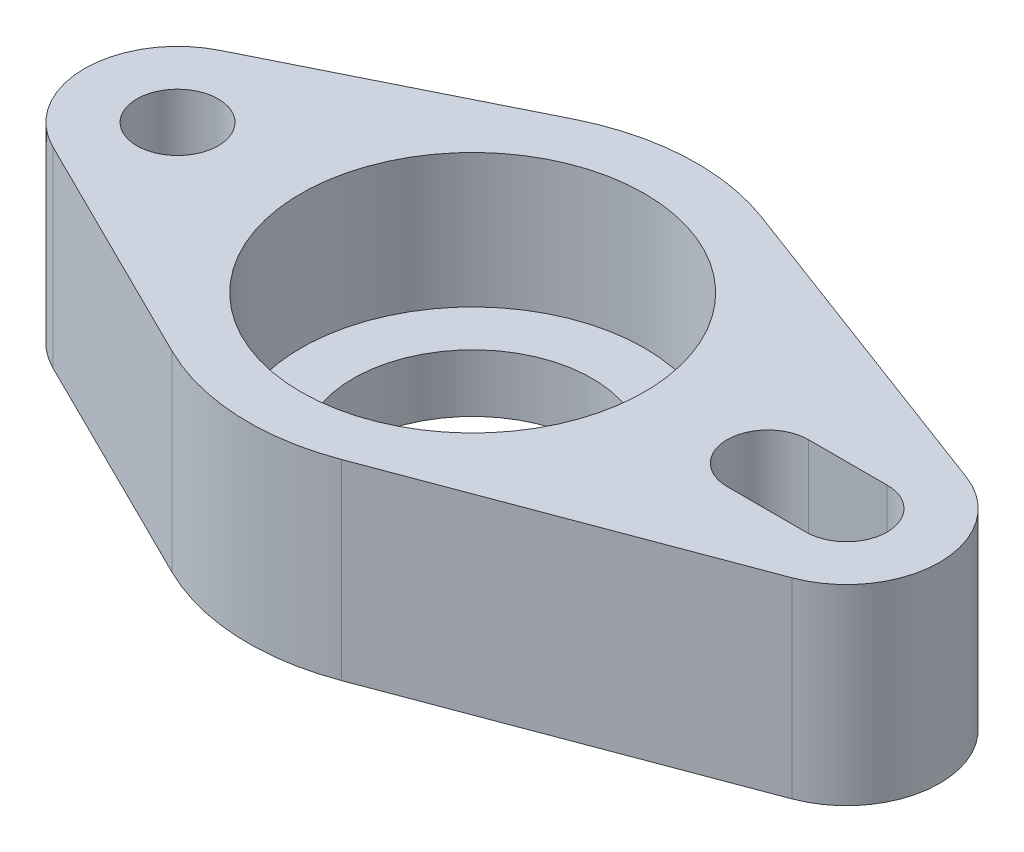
ISO-10303-21;
HEADER;
FILE_DESCRIPTION(('STEP AP214'),'2;1');
FILE_NAME('part.step','',(''),(''),'','','');
FILE_SCHEMA(('AUTOMOTIVE_DESIGN { 1 0 10303 214 1 1 1 1 }'));
ENDSEC;
DATA;
#1=APPLICATION_CONTEXT('core data for automotive mechanical design processes');
#2=APPLICATION_PROTOCOL_DEFINITION('international standard','automotive_design',2000,#1);
#3=PRODUCT_CONTEXT('',#1,'mechanical');
#4=PRODUCT('Part','Part','',(#3));
#5=PRODUCT_RELATED_PRODUCT_CATEGORY('part','',(#4));
#6=PRODUCT_DEFINITION_FORMATION('','',#4);
#7=PRODUCT_DEFINITION_CONTEXT('part definition',#1,'design');
#8=PRODUCT_DEFINITION('design','',#6,#7);
#9=PRODUCT_DEFINITION_SHAPE('','',#8);
#10=(LENGTH_UNIT() NAMED_UNIT(*) SI_UNIT(.MILLI.,.METRE.));
#11=(NAMED_UNIT(*) PLANE_ANGLE_UNIT() SI_UNIT($,.RADIAN.));
#12=(NAMED_UNIT(*) SI_UNIT($,.STERADIAN.) SOLID_ANGLE_UNIT());
#13=UNCERTAINTY_MEASURE_WITH_UNIT(LENGTH_MEASURE(1.E-05),#10,'distance_accuracy_value','');
#14=(GEOMETRIC_REPRESENTATION_CONTEXT(3) GLOBAL_UNCERTAINTY_ASSIGNED_CONTEXT((#13)) GLOBAL_UNIT_ASSIGNED_CONTEXT((#10,
#11,#12)) REPRESENTATION_CONTEXT('',''));
#15=CARTESIAN_POINT('',(0.,0.,0.));
#16=DIRECTION('',(0.,0.,1.));
#17=DIRECTION('',(1.,0.,0.));
#18=AXIS2_PLACEMENT_3D('',#15,#16,#17);
#19=CARTESIAN_POINT('',(3.,7.3,8.00640368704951));
#20=DIRECTION('',(0.350877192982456,0.,0.93642148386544));
#21=DIRECTION('',(0.93642148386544,0.,-0.350877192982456));
#22=AXIS2_PLACEMENT_3D('',#19,#20,#21);
#23=PLANE('',#22);
#24=DIRECTION('',(-0.93642148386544,0.,0.350877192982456));
#25=VECTOR('',#24,1.);
#26=CARTESIAN_POINT('',(3.,0.,8.00640368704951));
#27=LINE('',#26,#25);
#28=CARTESIAN_POINT('',(15.4956140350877,0.,3.32429626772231));
#29=VERTEX_POINT('',#28);
#30=CARTESIAN_POINT('',(3.,0.,8.00640368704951));
#31=VERTEX_POINT('',#30);
#32=EDGE_CURVE('E207',#29,#31,#27,.T.);
#33=ORIENTED_EDGE('',*,*,#32,.F.);
#34=DIRECTION('',(0.,-1.,0.));
#35=VECTOR('',#34,1.);
#36=CARTESIAN_POINT('',(15.4956140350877,7.3,3.32429626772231));
#37=LINE('',#36,#35);
#38=CARTESIAN_POINT('',(15.4956140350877,7.3,3.32429626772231));
#39=VERTEX_POINT('',#38);
#40=EDGE_CURVE('E50',#39,#29,#37,.T.);
#41=ORIENTED_EDGE('',*,*,#40,.F.);
#42=DIRECTION('',(-0.93642148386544,0.,0.350877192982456));
#43=VECTOR('',#42,1.);
#44=CARTESIAN_POINT('',(3.,7.3,8.00640368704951));
#45=LINE('',#44,#43);
#46=CARTESIAN_POINT('',(3.,7.3,8.00640368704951));
#47=VERTEX_POINT('',#46);
#48=EDGE_CURVE('E236',#39,#47,#45,.T.);
#49=ORIENTED_EDGE('',*,*,#48,.T.);
#50=DIRECTION('',(0.,-1.,0.));
#51=VECTOR('',#50,1.);
#52=CARTESIAN_POINT('',(3.,7.3,8.00640368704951));
#53=LINE('',#52,#51);
#54=EDGE_CURVE('E105',#47,#31,#53,.T.);
#55=ORIENTED_EDGE('',*,*,#54,.T.);
#56=EDGE_LOOP('',(#33,#41,#49,#55));
#57=FACE_BOUND('',#56,.T.);
#58=ADVANCED_FACE('F41',(#57),#23,.T.);
#59=CARTESIAN_POINT('',(14.25,7.3,0.));
#60=DIRECTION('',(0.,-1.,0.));
#61=DIRECTION('',(0.,0.,-1.));
#62=AXIS2_PLACEMENT_3D('',#59,#60,#61);
#63=CYLINDRICAL_SURFACE('',#62,3.55);
#64=CARTESIAN_POINT('',(14.25,0.,0.));
#65=DIRECTION('',(0.,1.,0.));
#66=DIRECTION('',(0.,0.,1.));
#67=AXIS2_PLACEMENT_3D('',#64,#65,#66);
#68=CIRCLE('',#67,3.55);
#69=CARTESIAN_POINT('',(15.4956140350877,0.,-3.32429626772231));
#70=VERTEX_POINT('',#69);
#71=EDGE_CURVE('E204',#29,#70,#68,.T.);
#72=ORIENTED_EDGE('',*,*,#71,.T.);
#73=DIRECTION('',(0.,-1.,0.));
#74=VECTOR('',#73,1.);
#75=CARTESIAN_POINT('',(15.4956140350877,7.3,-3.32429626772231));
#76=LINE('',#75,#74);
#77=CARTESIAN_POINT('',(15.4956140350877,7.3,-3.32429626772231));
#78=VERTEX_POINT('',#77);
#79=EDGE_CURVE('E173',#78,#70,#76,.T.);
#80=ORIENTED_EDGE('',*,*,#79,.F.);
#81=CARTESIAN_POINT('',(14.25,7.3,0.));
#82=DIRECTION('',(0.,1.,0.));
#83=DIRECTION('',(0.,0.,1.));
#84=AXIS2_PLACEMENT_3D('',#81,#82,#83);
#85=CIRCLE('',#84,3.55);
#86=EDGE_CURVE('E233',#39,#78,#85,.T.);
#87=ORIENTED_EDGE('',*,*,#86,.F.);
#88=ORIENTED_EDGE('',*,*,#40,.T.);
#89=EDGE_LOOP('',(#72,#80,#87,#88));
#90=FACE_BOUND('',#89,.T.);
#91=ADVANCED_FACE('F293',(#90),#63,.T.);
#92=CARTESIAN_POINT('',(3.,7.3,-8.00640368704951));
#93=DIRECTION('',(-0.350877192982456,0.,0.93642148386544));
#94=DIRECTION('',(0.93642148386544,0.,0.350877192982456));
#95=AXIS2_PLACEMENT_3D('',#92,#93,#94);
#96=PLANE('',#95);
#97=DIRECTION('',(-0.93642148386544,0.,-0.350877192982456));
#98=VECTOR('',#97,1.);
#99=CARTESIAN_POINT('',(3.,0.,-8.00640368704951));
#100=LINE('',#99,#98);
#101=CARTESIAN_POINT('',(3.,0.,-8.00640368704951));
#102=VERTEX_POINT('',#101);
#103=EDGE_CURVE('E201',#70,#102,#100,.T.);
#104=ORIENTED_EDGE('',*,*,#103,.T.);
#105=DIRECTION('',(0.,-1.,0.));
#106=VECTOR('',#105,1.);
#107=CARTESIAN_POINT('',(3.,7.3,-8.00640368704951));
#108=LINE('',#107,#106);
#109=CARTESIAN_POINT('',(3.,7.3,-8.00640368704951));
#110=VERTEX_POINT('',#109);
#111=EDGE_CURVE('E170',#110,#102,#108,.T.);
#112=ORIENTED_EDGE('',*,*,#111,.F.);
#113=DIRECTION('',(-0.93642148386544,0.,-0.350877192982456));
#114=VECTOR('',#113,1.);
#115=CARTESIAN_POINT('',(3.,7.3,-8.00640368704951));
#116=LINE('',#115,#114);
#117=EDGE_CURVE('E230',#78,#110,#116,.T.);
#118=ORIENTED_EDGE('',*,*,#117,.F.);
#119=ORIENTED_EDGE('',*,*,#79,.T.);
#120=EDGE_LOOP('',(#104,#112,#118,#119));
#121=FACE_BOUND('',#120,.T.);
#122=ADVANCED_FACE('F298',(#121),#96,.F.);
#123=CARTESIAN_POINT('',(0.,7.3,0.));
#124=DIRECTION('',(0.,-1.,0.));
#125=DIRECTION('',(0.,0.,-1.));
#126=AXIS2_PLACEMENT_3D('',#123,#124,#125);
#127=CYLINDRICAL_SURFACE('',#126,8.55);
#128=CARTESIAN_POINT('',(0.,0.,0.));
#129=DIRECTION('',(0.,1.,0.));
#130=DIRECTION('',(0.,0.,1.));
#131=AXIS2_PLACEMENT_3D('',#128,#129,#130);
#132=CIRCLE('',#131,8.55);
#133=CARTESIAN_POINT('',(-3.8,0.,-7.65914486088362));
#134=VERTEX_POINT('',#133);
#135=EDGE_CURVE('E198',#102,#134,#132,.T.);
#136=ORIENTED_EDGE('',*,*,#135,.T.);
#137=DIRECTION('',(0.,-1.,0.));
#138=VECTOR('',#137,1.);
#139=CARTESIAN_POINT('',(-3.8,7.3,-7.65914486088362));
#140=LINE('',#139,#138);
#141=CARTESIAN_POINT('',(-3.8,7.3,-7.65914486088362));
#142=VERTEX_POINT('',#141);
#143=EDGE_CURVE('E164',#142,#134,#140,.T.);
#144=ORIENTED_EDGE('',*,*,#143,.F.);
#145=CARTESIAN_POINT('',(0.,7.3,0.));
#146=DIRECTION('',(0.,1.,0.));
#147=DIRECTION('',(0.,0.,1.));
#148=AXIS2_PLACEMENT_3D('',#145,#146,#147);
#149=CIRCLE('',#148,8.55);
#150=EDGE_CURVE('E228',#110,#142,#149,.T.);
#151=ORIENTED_EDGE('',*,*,#150,.F.);
#152=ORIENTED_EDGE('',*,*,#111,.T.);
#153=EDGE_LOOP('',(#136,#144,#151,#152));
#154=FACE_BOUND('',#153,.T.);
#155=ADVANCED_FACE('F326',(#154),#127,.T.);
#156=CARTESIAN_POINT('',(-3.8,7.3,-7.65914486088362));
#157=DIRECTION('',(-0.444444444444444,0.,-0.895806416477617));
#158=DIRECTION('',(-0.895806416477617,0.,0.444444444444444));
#159=AXIS2_PLACEMENT_3D('',#156,#157,#158);
#160=PLANE('',#159);
#161=DIRECTION('',(0.895806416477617,0.,-0.444444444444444));
#162=VECTOR('',#161,1.);
#163=CARTESIAN_POINT('',(-3.8,0.,-7.65914486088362));
#164=LINE('',#163,#162);
#165=CARTESIAN_POINT('',(-12.8277777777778,0.,-3.18011277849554));
#166=VERTEX_POINT('',#165);
#167=EDGE_CURVE('E195',#166,#134,#164,.T.);
#168=ORIENTED_EDGE('',*,*,#167,.F.);
#169=DIRECTION('',(0.,-1.,0.));
#170=VECTOR('',#169,1.);
#171=CARTESIAN_POINT('',(-12.8277777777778,7.3,-3.18011277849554));
#172=LINE('',#171,#170);
#173=CARTESIAN_POINT('',(-12.8277777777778,7.3,-3.18011277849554));
#174=VERTEX_POINT('',#173);
#175=EDGE_CURVE('E162',#174,#166,#172,.T.);
#176=ORIENTED_EDGE('',*,*,#175,.F.);
#177=DIRECTION('',(0.895806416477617,0.,-0.444444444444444));
#178=VECTOR('',#177,1.);
#179=CARTESIAN_POINT('',(-3.8,7.3,-7.65914486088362));
#180=LINE('',#179,#178);
#181=EDGE_CURVE('E156',#174,#142,#180,.T.);
#182=ORIENTED_EDGE('',*,*,#181,.T.);
#183=ORIENTED_EDGE('',*,*,#143,.T.);
#184=EDGE_LOOP('',(#168,#176,#182,#183));
#185=FACE_BOUND('',#184,.T.);
#186=ADVANCED_FACE('F329',(#185),#160,.T.);
#187=CARTESIAN_POINT('',(-11.25,7.3,0.));
#188=DIRECTION('',(0.,-1.,0.));
#189=DIRECTION('',(0.,0.,-1.));
#190=AXIS2_PLACEMENT_3D('',#187,#188,#189);
#191=CYLINDRICAL_SURFACE('',#190,3.55);
#192=CARTESIAN_POINT('',(-11.25,0.,0.));
#193=DIRECTION('',(0.,1.,0.));
#194=DIRECTION('',(0.,0.,1.));
#195=AXIS2_PLACEMENT_3D('',#192,#193,#194);
#196=CIRCLE('',#195,3.55);
#197=CARTESIAN_POINT('',(-12.8277777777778,0.,3.18011277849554));
#198=VERTEX_POINT('',#197);
#199=EDGE_CURVE('E161',#166,#198,#196,.T.);
#200=ORIENTED_EDGE('',*,*,#199,.T.);
#201=DIRECTION('',(0.,-1.,0.));
#202=VECTOR('',#201,1.);
#203=CARTESIAN_POINT('',(-12.8277777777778,7.3,3.18011277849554));
#204=LINE('',#203,#202);
#205=CARTESIAN_POINT('',(-12.8277777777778,7.3,3.18011277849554));
#206=VERTEX_POINT('',#205);
#207=EDGE_CURVE('E146',#206,#198,#204,.T.);
#208=ORIENTED_EDGE('',*,*,#207,.F.);
#209=CARTESIAN_POINT('',(-11.25,7.3,0.));
#210=DIRECTION('',(0.,1.,0.));
#211=DIRECTION('',(0.,0.,1.));
#212=AXIS2_PLACEMENT_3D('',#209,#210,#211);
#213=CIRCLE('',#212,3.55);
#214=EDGE_CURVE('E149',#174,#206,#213,.T.);
#215=ORIENTED_EDGE('',*,*,#214,.F.);
#216=ORIENTED_EDGE('',*,*,#175,.T.);
#217=EDGE_LOOP('',(#200,#208,#215,#216));
#218=FACE_BOUND('',#217,.T.);
#219=ADVANCED_FACE('F159',(#218),#191,.T.);
#220=CARTESIAN_POINT('',(-3.8,7.3,7.65914486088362));
#221=DIRECTION('',(0.444444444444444,0.,-0.895806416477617));
#222=DIRECTION('',(-0.895806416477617,0.,-0.444444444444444));
#223=AXIS2_PLACEMENT_3D('',#220,#221,#222);
#224=PLANE('',#223);
#225=DIRECTION('',(0.895806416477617,0.,0.444444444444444));
#226=VECTOR('',#225,1.);
#227=CARTESIAN_POINT('',(-3.8,0.,7.65914486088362));
#228=LINE('',#227,#226);
#229=CARTESIAN_POINT('',(-3.8,0.,7.65914486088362));
#230=VERTEX_POINT('',#229);
#231=EDGE_CURVE('E192',#198,#230,#228,.T.);
#232=ORIENTED_EDGE('',*,*,#231,.T.);
#233=DIRECTION('',(0.,-1.,0.));
#234=VECTOR('',#233,1.);
#235=CARTESIAN_POINT('',(-3.8,7.3,7.65914486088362));
#236=LINE('',#235,#234);
#237=CARTESIAN_POINT('',(-3.8,7.3,7.65914486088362));
#238=VERTEX_POINT('',#237);
#239=EDGE_CURVE('E148',#238,#230,#236,.T.);
#240=ORIENTED_EDGE('',*,*,#239,.F.);
#241=DIRECTION('',(0.895806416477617,0.,0.444444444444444));
#242=VECTOR('',#241,1.);
#243=CARTESIAN_POINT('',(-3.8,7.3,7.65914486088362));
#244=LINE('',#243,#242);
#245=EDGE_CURVE('E141',#206,#238,#244,.T.);
#246=ORIENTED_EDGE('',*,*,#245,.F.);
#247=ORIENTED_EDGE('',*,*,#207,.T.);
#248=EDGE_LOOP('',(#232,#240,#246,#247));
#249=FACE_BOUND('',#248,.T.);
#250=ADVANCED_FACE('F144',(#249),#224,.F.);
#251=CARTESIAN_POINT('',(11.25,7.3,0.));
#252=DIRECTION('',(0.,-1.,0.));
#253=DIRECTION('',(0.,0.,-1.));
#254=AXIS2_PLACEMENT_3D('',#251,#252,#253);
#255=CYLINDRICAL_SURFACE('',#254,1.55);
#256=CARTESIAN_POINT('',(11.25,0.,0.));
#257=DIRECTION('',(0.,1.,0.));
#258=DIRECTION('',(0.,0.,1.));
#259=AXIS2_PLACEMENT_3D('',#256,#257,#258);
#260=CIRCLE('',#259,1.55);
#261=CARTESIAN_POINT('',(11.25,0.,-1.55));
#262=VERTEX_POINT('',#261);
#263=CARTESIAN_POINT('',(11.25,0.,1.55));
#264=VERTEX_POINT('',#263);
#265=EDGE_CURVE('E217',#262,#264,#260,.T.);
#266=ORIENTED_EDGE('',*,*,#265,.F.);
#267=DIRECTION('',(0.,-1.,0.));
#268=VECTOR('',#267,1.);
#269=CARTESIAN_POINT('',(11.25,7.3,-1.55));
#270=LINE('',#269,#268);
#271=CARTESIAN_POINT('',(11.25,7.3,-1.55));
#272=VERTEX_POINT('',#271);
#273=EDGE_CURVE('E112',#272,#262,#270,.T.);
#274=ORIENTED_EDGE('',*,*,#273,.F.);
#275=CARTESIAN_POINT('',(11.25,7.3,0.));
#276=DIRECTION('',(0.,1.,0.));
#277=DIRECTION('',(0.,0.,1.));
#278=AXIS2_PLACEMENT_3D('',#275,#276,#277);
#279=CIRCLE('',#278,1.55);
#280=CARTESIAN_POINT('',(11.25,7.3,1.55));
#281=VERTEX_POINT('',#280);
#282=EDGE_CURVE('E190',#272,#281,#279,.T.);
#283=ORIENTED_EDGE('',*,*,#282,.T.);
#284=DIRECTION('',(0.,-1.,0.));
#285=VECTOR('',#284,1.);
#286=CARTESIAN_POINT('',(11.25,7.3,1.55));
#287=LINE('',#286,#285);
#288=EDGE_CURVE('E177',#281,#264,#287,.T.);
#289=ORIENTED_EDGE('',*,*,#288,.T.);
#290=EDGE_LOOP('',(#266,#274,#283,#289));
#291=FACE_BOUND('',#290,.T.);
#292=ADVANCED_FACE('F43',(#291),#255,.F.);
#293=CARTESIAN_POINT('',(0.,7.3,-1.55));
#294=DIRECTION('',(0.,0.,-1.));
#295=DIRECTION('',(-1.,0.,0.));
#296=AXIS2_PLACEMENT_3D('',#293,#294,#295);
#297=PLANE('',#296);
#298=DIRECTION('',(1.,0.,0.));
#299=VECTOR('',#298,1.);
#300=CARTESIAN_POINT('',(0.,0.,-1.55));
#301=LINE('',#300,#299);
#302=CARTESIAN_POINT('',(14.25,0.,-1.55));
#303=VERTEX_POINT('',#302);
#304=EDGE_CURVE('E215',#262,#303,#301,.T.);
#305=ORIENTED_EDGE('',*,*,#304,.T.);
#306=DIRECTION('',(0.,-1.,0.));
#307=VECTOR('',#306,1.);
#308=CARTESIAN_POINT('',(14.25,7.3,-1.55));
#309=LINE('',#308,#307);
#310=CARTESIAN_POINT('',(14.25,7.3,-1.55));
#311=VERTEX_POINT('',#310);
#312=EDGE_CURVE('E182',#311,#303,#309,.T.);
#313=ORIENTED_EDGE('',*,*,#312,.F.);
#314=DIRECTION('',(1.,0.,0.));
#315=VECTOR('',#314,1.);
#316=CARTESIAN_POINT('',(0.,7.3,-1.55));
#317=LINE('',#316,#315);
#318=EDGE_CURVE('E244',#272,#311,#317,.T.);
#319=ORIENTED_EDGE('',*,*,#318,.F.);
#320=ORIENTED_EDGE('',*,*,#273,.T.);
#321=EDGE_LOOP('',(#305,#313,#319,#320));
#322=FACE_BOUND('',#321,.T.);
#323=ADVANCED_FACE('F307',(#322),#297,.F.);
#324=CARTESIAN_POINT('',(14.25,7.3,0.));
#325=DIRECTION('',(0.,-1.,0.));
#326=DIRECTION('',(0.,0.,-1.));
#327=AXIS2_PLACEMENT_3D('',#324,#325,#326);
#328=CYLINDRICAL_SURFACE('',#327,1.55);
#329=CARTESIAN_POINT('',(14.25,0.,0.));
#330=DIRECTION('',(0.,1.,0.));
#331=DIRECTION('',(0.,0.,1.));
#332=AXIS2_PLACEMENT_3D('',#329,#330,#331);
#333=CIRCLE('',#332,1.55);
#334=CARTESIAN_POINT('',(14.25,0.,1.55));
#335=VERTEX_POINT('',#334);
#336=EDGE_CURVE('E212',#335,#303,#333,.T.);
#337=ORIENTED_EDGE('',*,*,#336,.F.);
#338=DIRECTION('',(0.,-1.,0.));
#339=VECTOR('',#338,1.);
#340=CARTESIAN_POINT('',(14.25,7.3,1.55));
#341=LINE('',#340,#339);
#342=CARTESIAN_POINT('',(14.25,7.3,1.55));
#343=VERTEX_POINT('',#342);
#344=EDGE_CURVE('E179',#343,#335,#341,.T.);
#345=ORIENTED_EDGE('',*,*,#344,.F.);
#346=CARTESIAN_POINT('',(14.25,7.3,0.));
#347=DIRECTION('',(0.,1.,0.));
#348=DIRECTION('',(0.,0.,1.));
#349=AXIS2_PLACEMENT_3D('',#346,#347,#348);
#350=CIRCLE('',#349,1.55);
#351=EDGE_CURVE('E241',#343,#311,#350,.T.);
#352=ORIENTED_EDGE('',*,*,#351,.T.);
#353=ORIENTED_EDGE('',*,*,#312,.T.);
#354=EDGE_LOOP('',(#337,#345,#352,#353));
#355=FACE_BOUND('',#354,.T.);
#356=ADVANCED_FACE('F266',(#355),#328,.F.);
#357=CARTESIAN_POINT('',(0.,7.3,0.));
#358=DIRECTION('',(0.,-1.,0.));
#359=DIRECTION('',(0.,0.,-1.));
#360=AXIS2_PLACEMENT_3D('',#357,#358,#359);
#361=CYLINDRICAL_SURFACE('',#360,6.55);
#362=CARTESIAN_POINT('',(0.,2.2,0.));
#363=DIRECTION('',(0.,1.,0.));
#364=DIRECTION('',(0.,0.,1.));
#365=AXIS2_PLACEMENT_3D('',#362,#363,#364);
#366=CIRCLE('',#365,6.55);
#367=CARTESIAN_POINT('',(0.,2.2,6.55));
#368=VERTEX_POINT('',#367);
#369=EDGE_CURVE('E11',#368,#368,#366,.T.);
#370=ORIENTED_EDGE('',*,*,#369,.F.);
#371=EDGE_LOOP('',(#370));
#372=FACE_BOUND('',#371,.T.);
#373=CARTESIAN_POINT('',(0.,7.3,0.));
#374=DIRECTION('',(0.,1.,0.));
#375=DIRECTION('',(0.,0.,1.));
#376=AXIS2_PLACEMENT_3D('',#373,#374,#375);
#377=CIRCLE('',#376,6.55);
#378=CARTESIAN_POINT('',(0.,7.3,6.55));
#379=VERTEX_POINT('',#378);
#380=EDGE_CURVE('E223',#379,#379,#377,.T.);
#381=ORIENTED_EDGE('',*,*,#380,.T.);
#382=EDGE_LOOP('',(#381));
#383=FACE_BOUND('',#382,.T.);
#384=ADVANCED_FACE('F262',(#372,#383),#361,.F.);
#385=CARTESIAN_POINT('',(0.,7.3,0.));
#386=DIRECTION('',(0.,-1.,0.));
#387=DIRECTION('',(0.,0.,-1.));
#388=AXIS2_PLACEMENT_3D('',#385,#386,#387);
#389=CYLINDRICAL_SURFACE('',#388,8.55);
#390=CARTESIAN_POINT('',(0.,0.,0.));
#391=DIRECTION('',(0.,1.,0.));
#392=DIRECTION('',(0.,0.,1.));
#393=AXIS2_PLACEMENT_3D('',#390,#391,#392);
#394=CIRCLE('',#393,8.55);
#395=EDGE_CURVE('E98',#230,#31,#394,.T.);
#396=ORIENTED_EDGE('',*,*,#395,.T.);
#397=ORIENTED_EDGE('',*,*,#54,.F.);
#398=CARTESIAN_POINT('',(0.,7.3,0.));
#399=DIRECTION('',(0.,1.,0.));
#400=DIRECTION('',(0.,0.,1.));
#401=AXIS2_PLACEMENT_3D('',#398,#399,#400);
#402=CIRCLE('',#401,8.55);
#403=EDGE_CURVE('E58',#238,#47,#402,.T.);
#404=ORIENTED_EDGE('',*,*,#403,.F.);
#405=ORIENTED_EDGE('',*,*,#239,.T.);
#406=EDGE_LOOP('',(#396,#397,#404,#405));
#407=FACE_BOUND('',#406,.T.);
#408=ADVANCED_FACE('F265',(#407),#389,.T.);
#409=CARTESIAN_POINT('',(0.,7.3,1.55));
#410=DIRECTION('',(0.,0.,-1.));
#411=DIRECTION('',(-1.,0.,0.));
#412=AXIS2_PLACEMENT_3D('',#409,#410,#411);
#413=PLANE('',#412);
#414=DIRECTION('',(1.,0.,0.));
#415=VECTOR('',#414,1.);
#416=CARTESIAN_POINT('',(0.,0.,1.55));
#417=LINE('',#416,#415);
#418=EDGE_CURVE('E209',#264,#335,#417,.T.);
#419=ORIENTED_EDGE('',*,*,#418,.F.);
#420=ORIENTED_EDGE('',*,*,#288,.F.);
#421=DIRECTION('',(1.,0.,0.));
#422=VECTOR('',#421,1.);
#423=CARTESIAN_POINT('',(0.,7.3,1.55));
#424=LINE('',#423,#422);
#425=EDGE_CURVE('E238',#281,#343,#424,.T.);
#426=ORIENTED_EDGE('',*,*,#425,.T.);
#427=ORIENTED_EDGE('',*,*,#344,.T.);
#428=EDGE_LOOP('',(#419,#420,#426,#427));
#429=FACE_BOUND('',#428,.T.);
#430=ADVANCED_FACE('F279',(#429),#413,.T.);
#431=CARTESIAN_POINT('',(-11.25,7.3,0.));
#432=DIRECTION('',(0.,-1.,0.));
#433=DIRECTION('',(0.,0.,-1.));
#434=AXIS2_PLACEMENT_3D('',#431,#432,#433);
#435=CYLINDRICAL_SURFACE('',#434,1.55);
#436=CARTESIAN_POINT('',(-11.25,7.3,0.));
#437=DIRECTION('',(0.,1.,0.));
#438=DIRECTION('',(0.,0.,1.));
#439=AXIS2_PLACEMENT_3D('',#436,#437,#438);
#440=CIRCLE('',#439,1.55);
#441=CARTESIAN_POINT('',(-11.25,7.3,1.55));
#442=VERTEX_POINT('',#441);
#443=EDGE_CURVE('E180',#442,#442,#440,.T.);
#444=ORIENTED_EDGE('',*,*,#443,.T.);
#445=EDGE_LOOP('',(#444));
#446=FACE_BOUND('',#445,.T.);
#447=CARTESIAN_POINT('',(-11.25,0.,0.));
#448=DIRECTION('',(0.,1.,0.));
#449=DIRECTION('',(0.,0.,1.));
#450=AXIS2_PLACEMENT_3D('',#447,#448,#449);
#451=CIRCLE('',#450,1.55);
#452=CARTESIAN_POINT('',(-11.25,0.,1.55));
#453=VERTEX_POINT('',#452);
#454=EDGE_CURVE('E187',#453,#453,#451,.T.);
#455=ORIENTED_EDGE('',*,*,#454,.F.);
#456=EDGE_LOOP('',(#455));
#457=FACE_BOUND('',#456,.T.);
#458=ADVANCED_FACE('F272',(#446,#457),#435,.F.);
#459=CARTESIAN_POINT('',(0.,7.3,0.));
#460=DIRECTION('',(0.,1.,0.));
#461=DIRECTION('',(0.,0.,1.));
#462=AXIS2_PLACEMENT_3D('',#459,#460,#461);
#463=PLANE('',#462);
#464=ORIENTED_EDGE('',*,*,#282,.F.);
#465=ORIENTED_EDGE('',*,*,#318,.T.);
#466=ORIENTED_EDGE('',*,*,#351,.F.);
#467=ORIENTED_EDGE('',*,*,#425,.F.);
#468=EDGE_LOOP('',(#464,#465,#466,#467));
#469=FACE_BOUND('',#468,.T.);
#470=ORIENTED_EDGE('',*,*,#48,.F.);
#471=ORIENTED_EDGE('',*,*,#86,.T.);
#472=ORIENTED_EDGE('',*,*,#117,.T.);
#473=ORIENTED_EDGE('',*,*,#150,.T.);
#474=ORIENTED_EDGE('',*,*,#181,.F.);
#475=ORIENTED_EDGE('',*,*,#214,.T.);
#476=ORIENTED_EDGE('',*,*,#245,.T.);
#477=ORIENTED_EDGE('',*,*,#403,.T.);
#478=EDGE_LOOP('',(#470,#471,#472,#473,#474,#475,#476,#477));
#479=FACE_BOUND('',#478,.T.);
#480=ORIENTED_EDGE('',*,*,#380,.F.);
#481=EDGE_LOOP('',(#480));
#482=FACE_BOUND('',#481,.T.);
#483=ORIENTED_EDGE('',*,*,#443,.F.);
#484=EDGE_LOOP('',(#483));
#485=FACE_BOUND('',#484,.T.);
#486=ADVANCED_FACE('F153',(#469,#479,#482,#485),#463,.T.);
#487=CARTESIAN_POINT('',(0.,0.,0.));
#488=DIRECTION('',(0.,1.,0.));
#489=DIRECTION('',(0.,0.,1.));
#490=AXIS2_PLACEMENT_3D('',#487,#488,#489);
#491=PLANE('',#490);
#492=ORIENTED_EDGE('',*,*,#265,.T.);
#493=ORIENTED_EDGE('',*,*,#418,.T.);
#494=ORIENTED_EDGE('',*,*,#336,.T.);
#495=ORIENTED_EDGE('',*,*,#304,.F.);
#496=EDGE_LOOP('',(#492,#493,#494,#495));
#497=FACE_BOUND('',#496,.T.);
#498=ORIENTED_EDGE('',*,*,#32,.T.);
#499=ORIENTED_EDGE('',*,*,#395,.F.);
#500=ORIENTED_EDGE('',*,*,#231,.F.);
#501=ORIENTED_EDGE('',*,*,#199,.F.);
#502=ORIENTED_EDGE('',*,*,#167,.T.);
#503=ORIENTED_EDGE('',*,*,#135,.F.);
#504=ORIENTED_EDGE('',*,*,#103,.F.);
#505=ORIENTED_EDGE('',*,*,#71,.F.);
#506=EDGE_LOOP('',(#498,#499,#500,#501,#502,#503,#504,#505));
#507=FACE_BOUND('',#506,.T.);
#508=ORIENTED_EDGE('',*,*,#454,.T.);
#509=EDGE_LOOP('',(#508));
#510=FACE_BOUND('',#509,.T.);
#511=CARTESIAN_POINT('',(0.,0.,0.));
#512=DIRECTION('',(0.,1.,0.));
#513=DIRECTION('',(0.,0.,1.));
#514=AXIS2_PLACEMENT_3D('',#511,#512,#513);
#515=CIRCLE('',#514,4.55);
#516=CARTESIAN_POINT('',(0.,0.,4.55));
#517=VERTEX_POINT('',#516);
#518=EDGE_CURVE('E247',#517,#517,#515,.T.);
#519=ORIENTED_EDGE('',*,*,#518,.T.);
#520=EDGE_LOOP('',(#519));
#521=FACE_BOUND('',#520,.T.);
#522=ADVANCED_FACE('F271',(#497,#507,#510,#521),#491,.F.);
#523=CARTESIAN_POINT('',(0.,2.2,0.));
#524=DIRECTION('',(0.,-1.,0.));
#525=DIRECTION('',(0.,0.,-1.));
#526=AXIS2_PLACEMENT_3D('',#523,#524,#525);
#527=CYLINDRICAL_SURFACE('',#526,4.55);
#528=CARTESIAN_POINT('',(0.,2.2,0.));
#529=DIRECTION('',(0.,1.,0.));
#530=DIRECTION('',(0.,0.,1.));
#531=AXIS2_PLACEMENT_3D('',#528,#529,#530);
#532=CIRCLE('',#531,4.55);
#533=CARTESIAN_POINT('',(0.,2.2,4.55));
#534=VERTEX_POINT('',#533);
#535=EDGE_CURVE('E220',#534,#534,#532,.T.);
#536=ORIENTED_EDGE('',*,*,#535,.T.);
#537=EDGE_LOOP('',(#536));
#538=FACE_BOUND('',#537,.T.);
#539=ORIENTED_EDGE('',*,*,#518,.F.);
#540=EDGE_LOOP('',(#539));
#541=FACE_BOUND('',#540,.T.);
#542=ADVANCED_FACE('F253',(#538,#541),#527,.F.);
#543=CARTESIAN_POINT('',(0.,2.2,0.));
#544=DIRECTION('',(0.,1.,0.));
#545=DIRECTION('',(0.,0.,1.));
#546=AXIS2_PLACEMENT_3D('',#543,#544,#545);
#547=PLANE('',#546);
#548=ORIENTED_EDGE('',*,*,#535,.F.);
#549=EDGE_LOOP('',(#548));
#550=FACE_BOUND('',#549,.T.);
#551=ORIENTED_EDGE('',*,*,#369,.T.);
#552=EDGE_LOOP('',(#551));
#553=FACE_BOUND('',#552,.T.);
#554=ADVANCED_FACE('F256',(#550,#553),#547,.T.);
#555=CLOSED_SHELL('',(#58,#91,#122,#155,#186,#219,#250,#292,#323,#356,#384,#408,#430,#458,#486,
#522,#542,#554));
#556=MANIFOLD_SOLID_BREP('B2',#555);
#557=ADVANCED_BREP_SHAPE_REPRESENTATION('',(#18,#556),#14);
#558=SHAPE_DEFINITION_REPRESENTATION(#9,#557);
ENDSEC;
END-ISO-10303-21;
